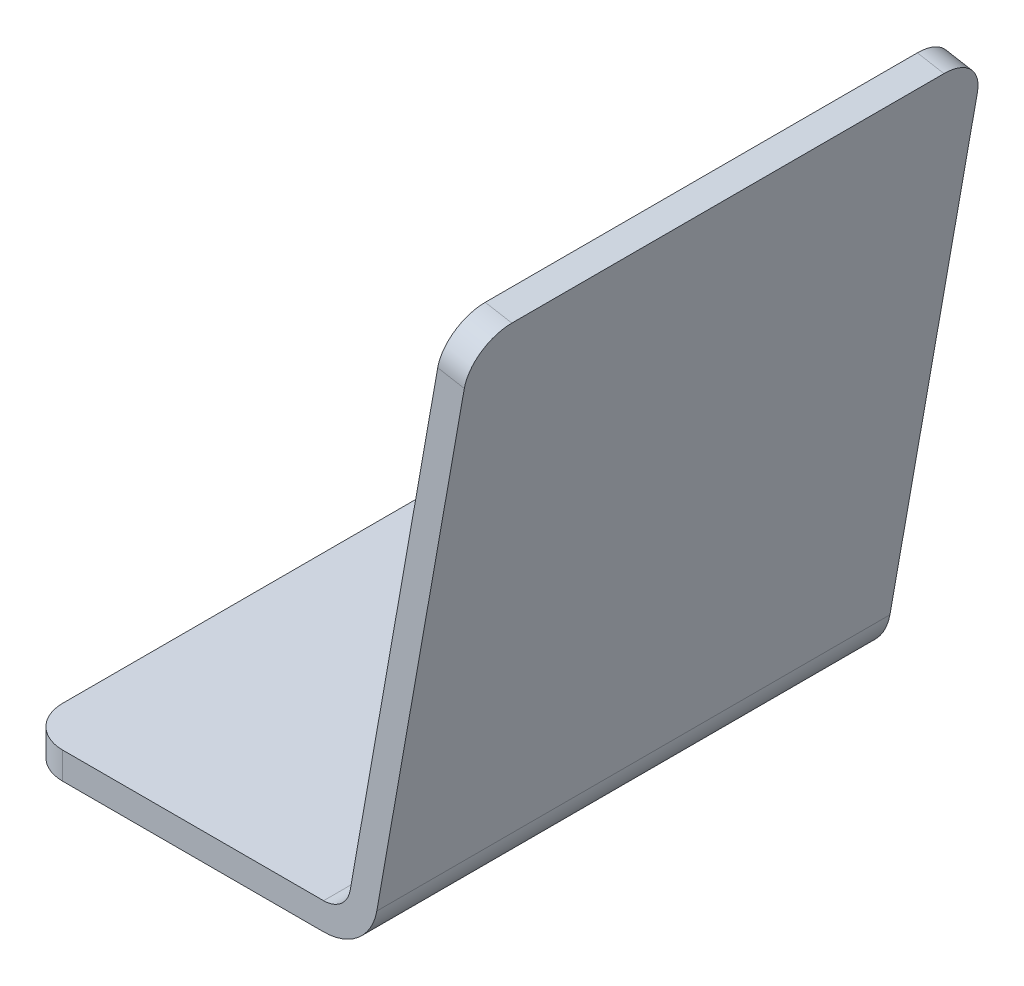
from build123d import *

# Parameters (mm, degrees)
EXTRU_MINCE1_DEPTH      = 38
CONG_1_R                = 3
ESQUISSE2_R             = 1.6
ENL_V_MAT_EXTRU_1_DEPTH = 66.278061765
CHANFREIN1_SIZE         = 0.577350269
CHANFREIN1_SIZE2        = 1


with BuildPart() as part:
    # Esquisse1 → Extru.-Mince1 (new body)
    with BuildSketch(Plane.XY):
        with BuildLine():
            Line((0, 0), (22.321800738, 0))
            ThreePointArc((22.321800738, 0), (23.607375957, 0.467911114), (24.291416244, 1.652703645))
            Line((24.291416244, 1.652703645), (31.293223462, 41.361925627))
            Line((31.293223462, 41.361925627), (33.262838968, 41.014629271))
            Line((33.262838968, 41.014629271), (26.26103175, 1.305407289))
            ThreePointArc((26.26103175, 1.305407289), (24.892951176, -1.064177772), (22.321800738, -2))
            Line((22.321800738, -2), (0, -2))
            Line((0, -2), (0, 0))
        make_face()
    extrude(amount=EXTRU_MINCE1_DEPTH)

    # Cong_1
    cong_1_edges = [part.edges().sort_by_distance(p)[0] for p in [
        (0, -1, 38),
        (0, -1, 0),
        (32.278031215, 41.188277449, 38),
        (32.278031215, 41.188277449, 0),
    ]]
    fillet(cong_1_edges, radius=CONG_1_R)

    # Esquisse2 → Enl_v. mat.-Extru.1 (cut, through all)
    with BuildSketch(Plane(origin=(0, 0, 0), x_dir=(-1, 0, 0), z_dir=(0, 1, 0))):
        with Locations((-13, 19)):
            Circle(ESQUISSE2_R)
    extrude(amount=-ENL_V_MAT_EXTRU_1_DEPTH, mode=Mode.SUBTRACT)

    # Chanfrein1
    chanfrein1_edges = [part.edges().sort_by_distance(p)[0] for p in [
        (14.6, 0, 19),
    ]]
    chanfrein1_side = [part.faces().sort_by_distance(p)[0] for p in [
        (14.6, -1, 19),
    ]]
    chamfer(chanfrein1_edges, length=CHANFREIN1_SIZE, length2=CHANFREIN1_SIZE2, reference=chanfrein1_side[0])


solid = part.part
